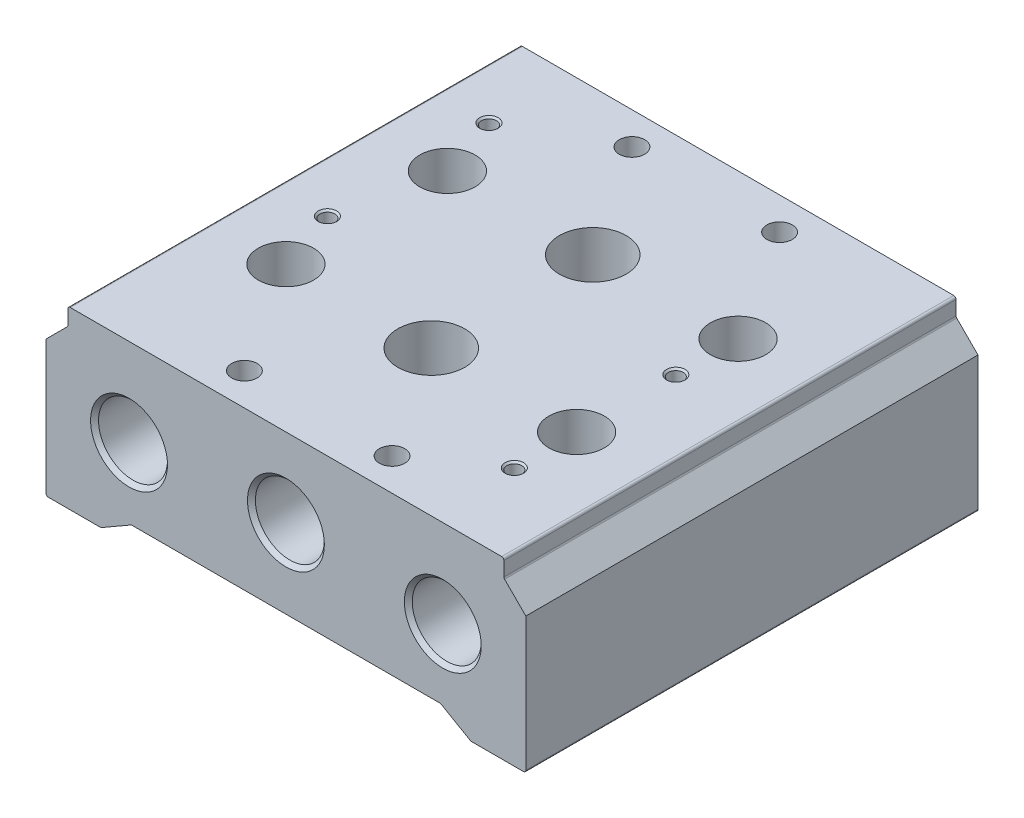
from build123d import *

# Parameters (mm, degrees)
EXTRUDE_1_DEPTH             = 98
SKETCH_2_R                  = 2.75
CUT_EXTRUDE_1_DEPTH         = 38
PATTERN_LINEAR_1_COUNT      = 2
PATTERN_LINEAR_1_PITCH      = 32
PATTERN_LINEAR_1_COUNT_DIR2 = 2
PATTERN_LINEAR_1_PITCH_DIR2 = 84
SKETCH_8_R                  = 7.25
CUT_EXTRUDE_2_DEPTH         = 13
PATTERN_LINEAR_2_COUNT      = 2
PATTERN_LINEAR_2_PITCH      = 35
SKETCH_10_R                 = 6
CUT_EXTRUDE_3_DEPTH         = 18
PATTERN_LINEAR_3_COUNT      = 2
PATTERN_LINEAR_3_PITCH      = 63
PATTERN_LINEAR_3_COUNT_DIR2 = 2
PATTERN_LINEAR_3_PITCH_DIR2 = 35
PATTERN_LINEAR_4_COUNT      = 2
PATTERN_LINEAR_4_PITCH      = 35
PATTERN_LINEAR_4_COUNT_DIR2 = 2
PATTERN_LINEAR_4_PITCH_DIR2 = 72.699724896


with BuildPart() as part:
    # Sketch 1 → Extrude 1 (new body)
    with BuildSketch(Plane.XY):
        with BuildLine():
            Line((-52, 29.45), (-52, 0.5))
            ThreePointArc((-52, 0.5), (-51.853553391, 0.146446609), (-51.5, 0))
            Line((-51.5, 0), (-40.215767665, 0))
            ThreePointArc((-40.215767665, 0), (-40.086358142, 0.017037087), (-39.965767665, 0.066987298))
            Line((-39.965767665, 0.066987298), (-33.616025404, 3.733012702))
            ThreePointArc((-33.616025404, 3.733012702), (-33.495434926, 3.782962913), (-33.366025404, 3.8))
            Line((-33.366025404, 3.8), (33.366025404, 3.8))
            ThreePointArc((33.366025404, 3.8), (33.495434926, 3.782962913), (33.616025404, 3.733012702))
            Line((33.616025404, 3.733012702), (39.965767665, 0.066987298))
            ThreePointArc((39.965767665, 0.066987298), (40.086358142, 0.017037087), (40.215767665, 0))
            Line((40.215767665, 0), (51.5, 0))
            ThreePointArc((51.5, 0), (51.853553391, 0.146446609), (52, 0.5))
            Line((52, 0.5), (52, 29.45))
            Line((52, 29.45), (47.396446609, 34.053553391))
            ThreePointArc((47.396446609, 34.053553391), (47.288060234, 34.215765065), (47.25, 34.407106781))
            Line((47.25, 34.407106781), (47.25, 37.5))
            ThreePointArc((47.25, 37.5), (47.103553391, 37.853553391), (46.75, 38))
            Line((46.75, 38), (-46.75, 38))
            ThreePointArc((-46.75, 38), (-47.103553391, 37.853553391), (-47.25, 37.5))
            Line((-47.25, 37.5), (-47.25, 34.407106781))
            ThreePointArc((-47.25, 34.407106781), (-47.288060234, 34.215765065), (-47.396446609, 34.053553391))
            Line((-47.396446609, 34.053553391), (-52, 29.45))
        make_face()
    extrude(amount=EXTRUDE_1_DEPTH)

    # Sketch 2 → Cut-Extrude 1 (cut)
    with BuildSketch(Plane(origin=(0, 0, 0), x_dir=(1, 0, 0), z_dir=(0, 1, 0))):
        with Locations(Location((-16, -91, 0), (0, 0, 270))):
            Circle(SKETCH_2_R)
    cut_extrude_1 = extrude(amount=CUT_EXTRUDE_1_DEPTH, mode=Mode.SUBTRACT)

    # Pattern Linear 1: Cut-Extrude 1 2 × 2
    with Locations(*[(i * PATTERN_LINEAR_1_PITCH, 0, -j * PATTERN_LINEAR_1_PITCH_DIR2) for i in range(PATTERN_LINEAR_1_COUNT) for j in range(PATTERN_LINEAR_1_COUNT_DIR2) if (i, j) != (0, 0)]):
        add(cut_extrude_1, mode=Mode.SUBTRACT)

    # Sketch 4 → Cut-Revolve 1 (revolve, cut)
    with BuildSketch(Plane(origin=(0, 19, 0), x_dir=(1, 0, 0), z_dir=(0, 1, 0)), mode=Mode.PRIVATE) as cut_revolve_1_sk:
        Polygon((34, -98), (25.669, -98), (26.525, -97.144), (26.525, -49), (34, -49), align=None)
    revolve(cut_revolve_1_sk.sketch.rotate(Axis((34, 19, 49), (0, 0, 1)), 180), axis=Axis((34, 19, 49), (0, 0, 1)), mode=Mode.SUBTRACT)

    # Sketch 5 → Cut-Revolve 2 (revolve, cut)
    with BuildSketch(Plane(origin=(0, 19, 0), x_dir=(1, 0, 0), z_dir=(0, 1, 0)), mode=Mode.PRIVATE) as cut_revolve_2_sk:
        Polygon((34, -49), (26.525, -49), (26.525, -0.856), (25.669, 0), (34, 0), align=None)
    revolve(cut_revolve_2_sk.sketch.rotate(Axis((34, 19, 0), (0, 0, 1)), 180), axis=Axis((34, 19, 0), (0, 0, 1)), mode=Mode.SUBTRACT)

    # Sketch 6 → Cut-Revolve 3 (revolve, cut)
    with BuildSketch(Plane(origin=(0, 19, 0), x_dir=(1, 0, 0), z_dir=(0, 1, 0)), mode=Mode.PRIVATE) as cut_revolve_3_sk:
        Polygon((-34, -98), (-42.331, -98), (-41.475, -97.144), (-41.475, -49), (-34, -49), align=None)
    revolve(cut_revolve_3_sk.sketch.rotate(Axis((-34, 19, 49), (0, 0, 1)), 180), axis=Axis((-34, 19, 49), (0, 0, 1)), mode=Mode.SUBTRACT)

    # Sketch 7 → Cut-Revolve 4 (revolve, cut)
    with BuildSketch(Plane(origin=(0, 19, 0), x_dir=(1, 0, 0), z_dir=(0, 1, 0)), mode=Mode.PRIVATE) as cut_revolve_4_sk:
        Polygon((-34, -49), (-41.475, -49), (-41.475, -0.856), (-42.331, 0), (-34, 0), align=None)
    revolve(cut_revolve_4_sk.sketch.rotate(Axis((-34, 19, 0), (0, 0, 1)), 180), axis=Axis((-34, 19, 0), (0, 0, 1)), mode=Mode.SUBTRACT)

    # Sketch 8 → Cut-Extrude 2 (cut)
    with BuildSketch(Plane(origin=(0, 38, 0), x_dir=(1, 0, 0), z_dir=(0, 1, 0))):
        with Locations(Location((0, -31.5, 0), (0, 0, 270))):
            Circle(SKETCH_8_R)
    cut_extrude_2 = extrude(amount=-CUT_EXTRUDE_2_DEPTH, mode=Mode.SUBTRACT)

    # Pattern Linear 2: Cut-Extrude 2 ×2
    with Locations(*[(0, 0, i * PATTERN_LINEAR_2_PITCH) for i in range(1, PATTERN_LINEAR_2_COUNT)]):
        add(cut_extrude_2, mode=Mode.SUBTRACT)

    # Sketch 10 → Cut-Extrude 3 (cut)
    with BuildSketch(Plane(origin=(0, 38, 0), x_dir=(1, 0, 0), z_dir=(0, 1, 0))):
        with Locations(Location((-31.5, -31.5, 0), (0, 0, 270))):
            Circle(SKETCH_10_R)
    cut_extrude_3 = extrude(amount=-CUT_EXTRUDE_3_DEPTH, mode=Mode.SUBTRACT)

    # Pattern Linear 3: Cut-Extrude 3 2 × 2
    with Locations(*[(i * PATTERN_LINEAR_3_PITCH, 0, j * PATTERN_LINEAR_3_PITCH_DIR2) for i in range(PATTERN_LINEAR_3_COUNT) for j in range(PATTERN_LINEAR_3_COUNT_DIR2) if (i, j) != (0, 0)]):
        add(cut_extrude_3, mode=Mode.SUBTRACT)

    # Sketch 12 → Cut-Revolve 5 (revolve, cut)
    with BuildSketch(Plane.XY.offset(18), mode=Mode.PRIVATE) as cut_revolve_5_sk:
        Polygon((-36, 31.064115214), (-37.621, 32), (-37.621, 37.621), (-38, 38), (-36, 38), align=None)
    cut_revolve_5 = revolve(cut_revolve_5_sk.sketch.rotate(Axis((-36, 38, 18), (0, -1, 0)), 90), axis=Axis((-36, 38, 18), (0, -1, 0)), mode=Mode.SUBTRACT)

    # Pattern Linear 4: Cut-Revolve 5 2 × 2
    with Locations(*[Vector(0, 0, 1) * (i * PATTERN_LINEAR_4_PITCH) + Vector(0.9284766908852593, 0, 0.371390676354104) * (j * PATTERN_LINEAR_4_PITCH_DIR2) for i in range(PATTERN_LINEAR_4_COUNT) for j in range(PATTERN_LINEAR_4_COUNT_DIR2) if (i, j) != (0, 0)]):
        add(cut_revolve_5, mode=Mode.SUBTRACT)

    # Sketch 14 → Cut-Revolve 6 (revolve, cut)
    with BuildSketch(Plane(origin=(0, 21, 0), x_dir=(1, 0, 0), z_dir=(0, 1, 0)), mode=Mode.PRIVATE) as cut_revolve_6_sk:
        Polygon((0, -98), (-8.331, -98), (-7.475, -97.144), (-7.475, -49), (0, -49), align=None)
    revolve(cut_revolve_6_sk.sketch.rotate(Axis((0, 21, 49), (0, 0, 1)), 180), axis=Axis((0, 21, 49), (0, 0, 1)), mode=Mode.SUBTRACT)

    # Sketch 15 → Cut-Revolve 7 (revolve, cut)
    with BuildSketch(Plane(origin=(0, 21, 0), x_dir=(1, 0, 0), z_dir=(0, 1, 0)), mode=Mode.PRIVATE) as cut_revolve_7_sk:
        Polygon((0, -49), (-7.475, -49), (-7.475, -0.856), (-8.331, 0), (0, 0), align=None)
    revolve(cut_revolve_7_sk.sketch.rotate(Axis((0, 21, 0), (0, 0, 1)), 180), axis=Axis((0, 21, 0), (0, 0, 1)), mode=Mode.SUBTRACT)


solid = part.part
